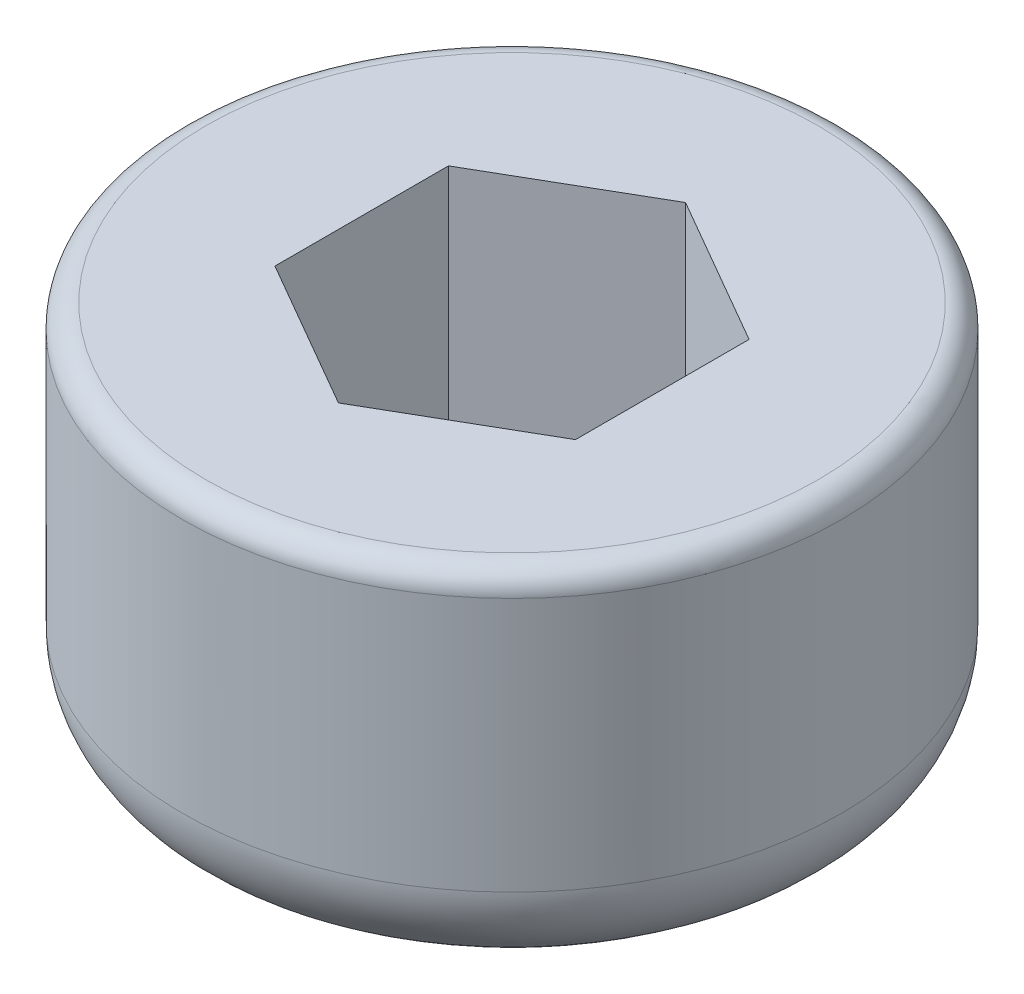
ISO-10303-21;
HEADER;
FILE_DESCRIPTION(('STEP AP214'),'2;1');
FILE_NAME('part.step','',(''),(''),'','','');
FILE_SCHEMA(('AUTOMOTIVE_DESIGN { 1 0 10303 214 1 1 1 1 }'));
ENDSEC;
DATA;
#1=APPLICATION_CONTEXT('core data for automotive mechanical design processes');
#2=APPLICATION_PROTOCOL_DEFINITION('international standard','automotive_design',2000,#1);
#3=PRODUCT_CONTEXT('',#1,'mechanical');
#4=PRODUCT('Part','Part','',(#3));
#5=PRODUCT_RELATED_PRODUCT_CATEGORY('part','',(#4));
#6=PRODUCT_DEFINITION_FORMATION('','',#4);
#7=PRODUCT_DEFINITION_CONTEXT('part definition',#1,'design');
#8=PRODUCT_DEFINITION('design','',#6,#7);
#9=PRODUCT_DEFINITION_SHAPE('','',#8);
#10=(LENGTH_UNIT() NAMED_UNIT(*) SI_UNIT(.MILLI.,.METRE.));
#11=(NAMED_UNIT(*) PLANE_ANGLE_UNIT() SI_UNIT($,.RADIAN.));
#12=(NAMED_UNIT(*) SI_UNIT($,.STERADIAN.) SOLID_ANGLE_UNIT());
#13=UNCERTAINTY_MEASURE_WITH_UNIT(LENGTH_MEASURE(1.E-05),#10,'distance_accuracy_value','');
#14=(GEOMETRIC_REPRESENTATION_CONTEXT(3) GLOBAL_UNCERTAINTY_ASSIGNED_CONTEXT((#13)) GLOBAL_UNIT_ASSIGNED_CONTEXT((#10,
#11,#12)) REPRESENTATION_CONTEXT('',''));
#15=CARTESIAN_POINT('',(0.,0.,0.));
#16=DIRECTION('',(0.,0.,1.));
#17=DIRECTION('',(1.,0.,0.));
#18=AXIS2_PLACEMENT_3D('',#15,#16,#17);
#19=CARTESIAN_POINT('',(0.,16.,0.));
#20=DIRECTION('',(0.,1.,0.));
#21=DIRECTION('',(-1.,0.,0.));
#22=AXIS2_PLACEMENT_3D('',#19,#20,#21);
#23=PLANE('',#22);
#24=CARTESIAN_POINT('',(0.,16.,0.));
#25=DIRECTION('',(0.,1.,0.));
#26=DIRECTION('',(-1.,0.,0.));
#27=AXIS2_PLACEMENT_3D('',#24,#25,#26);
#28=CIRCLE('',#27,13.25);
#29=CARTESIAN_POINT('',(-13.25,16.,0.));
#30=VERTEX_POINT('',#29);
#31=EDGE_CURVE('E11',#30,#30,#28,.T.);
#32=ORIENTED_EDGE('',*,*,#31,.T.);
#33=EDGE_LOOP('',(#32));
#34=FACE_BOUND('',#33,.T.);
#35=DIRECTION('',(-0.866025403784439,0.,-0.5));
#36=VECTOR('',#35,1.);
#37=CARTESIAN_POINT('',(6.5,16.,-3.75277674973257));
#38=LINE('',#37,#36);
#39=CARTESIAN_POINT('',(6.5,16.,-3.75277674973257));
#40=VERTEX_POINT('',#39);
#41=CARTESIAN_POINT('',(0.,16.,-7.50555349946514));
#42=VERTEX_POINT('',#41);
#43=EDGE_CURVE('E49',#40,#42,#38,.T.);
#44=ORIENTED_EDGE('',*,*,#43,.F.);
#45=DIRECTION('',(0.,0.,-1.));
#46=VECTOR('',#45,1.);
#47=CARTESIAN_POINT('',(6.5,16.,3.75277674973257));
#48=LINE('',#47,#46);
#49=CARTESIAN_POINT('',(6.5,16.,3.75277674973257));
#50=VERTEX_POINT('',#49);
#51=EDGE_CURVE('E106',#50,#40,#48,.T.);
#52=ORIENTED_EDGE('',*,*,#51,.F.);
#53=DIRECTION('',(0.866025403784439,0.,-0.5));
#54=VECTOR('',#53,1.);
#55=CARTESIAN_POINT('',(0.,16.,7.50555349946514));
#56=LINE('',#55,#54);
#57=CARTESIAN_POINT('',(0.,16.,7.50555349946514));
#58=VERTEX_POINT('',#57);
#59=EDGE_CURVE('E109',#58,#50,#56,.T.);
#60=ORIENTED_EDGE('',*,*,#59,.F.);
#61=DIRECTION('',(0.866025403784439,0.,0.5));
#62=VECTOR('',#61,1.);
#63=CARTESIAN_POINT('',(-6.50000000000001,16.,3.75277674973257));
#64=LINE('',#63,#62);
#65=CARTESIAN_POINT('',(-6.50000000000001,16.,3.75277674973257));
#66=VERTEX_POINT('',#65);
#67=EDGE_CURVE('E125',#66,#58,#64,.T.);
#68=ORIENTED_EDGE('',*,*,#67,.F.);
#69=DIRECTION('',(0.,0.,1.));
#70=VECTOR('',#69,1.);
#71=CARTESIAN_POINT('',(-6.50000000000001,16.,-3.75277674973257));
#72=LINE('',#71,#70);
#73=CARTESIAN_POINT('',(-6.50000000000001,16.,-3.75277674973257));
#74=VERTEX_POINT('',#73);
#75=EDGE_CURVE('E122',#74,#66,#72,.T.);
#76=ORIENTED_EDGE('',*,*,#75,.F.);
#77=DIRECTION('',(-0.866025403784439,0.,0.5));
#78=VECTOR('',#77,1.);
#79=CARTESIAN_POINT('',(0.,16.,-7.50555349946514));
#80=LINE('',#79,#78);
#81=EDGE_CURVE('E120',#42,#74,#80,.T.);
#82=ORIENTED_EDGE('',*,*,#81,.F.);
#83=EDGE_LOOP('',(#44,#52,#60,#68,#76,#82));
#84=FACE_BOUND('',#83,.T.);
#85=ADVANCED_FACE('F34',(#34,#84),#23,.T.);
#86=CARTESIAN_POINT('',(0.,0.,0.));
#87=DIRECTION('',(0.,-1.,0.));
#88=DIRECTION('',(1.,0.,0.));
#89=AXIS2_PLACEMENT_3D('',#86,#87,#88);
#90=CYLINDRICAL_SURFACE('',#89,14.25);
#91=CARTESIAN_POINT('',(0.,15.,0.));
#92=DIRECTION('',(0.,1.,0.));
#93=DIRECTION('',(-1.,0.,0.));
#94=AXIS2_PLACEMENT_3D('',#91,#92,#93);
#95=CIRCLE('',#94,14.25);
#96=CARTESIAN_POINT('',(-14.25,15.,0.));
#97=VERTEX_POINT('',#96);
#98=EDGE_CURVE('E42',#97,#97,#95,.F.);
#99=ORIENTED_EDGE('',*,*,#98,.T.);
#100=EDGE_LOOP('',(#99));
#101=FACE_BOUND('',#100,.T.);
#102=CARTESIAN_POINT('',(0.,4.00000000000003,0.));
#103=DIRECTION('',(0.,-1.,0.));
#104=DIRECTION('',(1.,0.,0.));
#105=AXIS2_PLACEMENT_3D('',#102,#103,#104);
#106=CIRCLE('',#105,14.25);
#107=CARTESIAN_POINT('',(14.25,4.00000000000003,0.));
#108=VERTEX_POINT('',#107);
#109=EDGE_CURVE('E142',#108,#108,#106,.T.);
#110=ORIENTED_EDGE('',*,*,#109,.F.);
#111=EDGE_LOOP('',(#110));
#112=FACE_BOUND('',#111,.T.);
#113=ADVANCED_FACE('F147',(#101,#112),#90,.T.);
#114=CARTESIAN_POINT('',(0.,4.,0.));
#115=DIRECTION('',(0.,-1.,0.));
#116=DIRECTION('',(1.,0.,0.));
#117=AXIS2_PLACEMENT_3D('',#114,#115,#116);
#118=TOROIDAL_SURFACE('',#117,10.25,4.);
#119=ORIENTED_EDGE('',*,*,#109,.T.);
#120=EDGE_LOOP('',(#119));
#121=FACE_BOUND('',#120,.T.);
#122=CARTESIAN_POINT('',(0.,0.,0.));
#123=DIRECTION('',(0.,-1.,0.));
#124=DIRECTION('',(1.,0.,0.));
#125=AXIS2_PLACEMENT_3D('',#122,#123,#124);
#126=CIRCLE('',#125,10.25);
#127=CARTESIAN_POINT('',(10.25,0.,0.));
#128=VERTEX_POINT('',#127);
#129=EDGE_CURVE('E132',#128,#128,#126,.T.);
#130=ORIENTED_EDGE('',*,*,#129,.F.);
#131=EDGE_LOOP('',(#130));
#132=FACE_BOUND('',#131,.T.);
#133=ADVANCED_FACE('F163',(#121,#132),#118,.T.);
#134=CARTESIAN_POINT('',(0.,0.,0.));
#135=DIRECTION('',(0.,-1.,0.));
#136=DIRECTION('',(1.,0.,0.));
#137=AXIS2_PLACEMENT_3D('',#134,#135,#136);
#138=PLANE('',#137);
#139=DIRECTION('',(-0.866025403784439,0.,-0.5));
#140=VECTOR('',#139,1.);
#141=CARTESIAN_POINT('',(6.5,0.,-3.75277674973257));
#142=LINE('',#141,#140);
#143=CARTESIAN_POINT('',(6.5,0.,-3.75277674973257));
#144=VERTEX_POINT('',#143);
#145=CARTESIAN_POINT('',(0.,0.,-7.50555349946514));
#146=VERTEX_POINT('',#145);
#147=EDGE_CURVE('E89',#144,#146,#142,.T.);
#148=ORIENTED_EDGE('',*,*,#147,.T.);
#149=DIRECTION('',(-0.866025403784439,0.,0.5));
#150=VECTOR('',#149,1.);
#151=CARTESIAN_POINT('',(0.,0.,-7.50555349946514));
#152=LINE('',#151,#150);
#153=CARTESIAN_POINT('',(-6.5,0.,-3.75277674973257));
#154=VERTEX_POINT('',#153);
#155=EDGE_CURVE('E98',#146,#154,#152,.T.);
#156=ORIENTED_EDGE('',*,*,#155,.T.);
#157=DIRECTION('',(0.,0.,1.));
#158=VECTOR('',#157,1.);
#159=CARTESIAN_POINT('',(-6.5,0.,-3.75277674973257));
#160=LINE('',#159,#158);
#161=CARTESIAN_POINT('',(-6.5,0.,3.75277674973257));
#162=VERTEX_POINT('',#161);
#163=EDGE_CURVE('E57',#154,#162,#160,.T.);
#164=ORIENTED_EDGE('',*,*,#163,.T.);
#165=DIRECTION('',(0.866025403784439,0.,0.5));
#166=VECTOR('',#165,1.);
#167=CARTESIAN_POINT('',(-6.5,0.,3.75277674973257));
#168=LINE('',#167,#166);
#169=CARTESIAN_POINT('',(0.,0.,7.50555349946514));
#170=VERTEX_POINT('',#169);
#171=EDGE_CURVE('E113',#162,#170,#168,.T.);
#172=ORIENTED_EDGE('',*,*,#171,.T.);
#173=DIRECTION('',(0.866025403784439,0.,-0.5));
#174=VECTOR('',#173,1.);
#175=CARTESIAN_POINT('',(0.,0.,7.50555349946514));
#176=LINE('',#175,#174);
#177=CARTESIAN_POINT('',(6.5,0.,3.75277674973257));
#178=VERTEX_POINT('',#177);
#179=EDGE_CURVE('E116',#170,#178,#176,.T.);
#180=ORIENTED_EDGE('',*,*,#179,.T.);
#181=DIRECTION('',(0.,0.,-1.));
#182=VECTOR('',#181,1.);
#183=CARTESIAN_POINT('',(6.5,0.,3.75277674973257));
#184=LINE('',#183,#182);
#185=EDGE_CURVE('E95',#178,#144,#184,.T.);
#186=ORIENTED_EDGE('',*,*,#185,.T.);
#187=EDGE_LOOP('',(#148,#156,#164,#172,#180,#186));
#188=FACE_BOUND('',#187,.T.);
#189=ORIENTED_EDGE('',*,*,#129,.T.);
#190=EDGE_LOOP('',(#189));
#191=FACE_BOUND('',#190,.T.);
#192=ADVANCED_FACE('F102',(#188,#191),#138,.T.);
#193=CARTESIAN_POINT('',(6.5,0.,-3.75277674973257));
#194=DIRECTION('',(0.5,0.,-0.866025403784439));
#195=DIRECTION('',(-0.866025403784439,0.,-0.5));
#196=AXIS2_PLACEMENT_3D('',#193,#194,#195);
#197=PLANE('',#196);
#198=ORIENTED_EDGE('',*,*,#43,.T.);
#199=DIRECTION('',(0.,1.,0.));
#200=VECTOR('',#199,1.);
#201=CARTESIAN_POINT('',(0.,0.,-7.50555349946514));
#202=LINE('',#201,#200);
#203=EDGE_CURVE('E85',#146,#42,#202,.T.);
#204=ORIENTED_EDGE('',*,*,#203,.F.);
#205=ORIENTED_EDGE('',*,*,#147,.F.);
#206=DIRECTION('',(0.,1.,0.));
#207=VECTOR('',#206,1.);
#208=CARTESIAN_POINT('',(6.5,0.,-3.75277674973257));
#209=LINE('',#208,#207);
#210=EDGE_CURVE('E130',#144,#40,#209,.T.);
#211=ORIENTED_EDGE('',*,*,#210,.T.);
#212=EDGE_LOOP('',(#198,#204,#205,#211));
#213=FACE_BOUND('',#212,.T.);
#214=ADVANCED_FACE('F87',(#213),#197,.F.);
#215=CARTESIAN_POINT('',(6.5,0.,3.75277674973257));
#216=DIRECTION('',(1.,0.,0.));
#217=DIRECTION('',(0.,1.,0.));
#218=AXIS2_PLACEMENT_3D('',#215,#216,#217);
#219=PLANE('',#218);
#220=ORIENTED_EDGE('',*,*,#51,.T.);
#221=ORIENTED_EDGE('',*,*,#210,.F.);
#222=ORIENTED_EDGE('',*,*,#185,.F.);
#223=DIRECTION('',(0.,1.,0.));
#224=VECTOR('',#223,1.);
#225=CARTESIAN_POINT('',(6.5,0.,3.75277674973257));
#226=LINE('',#225,#224);
#227=EDGE_CURVE('E133',#178,#50,#226,.T.);
#228=ORIENTED_EDGE('',*,*,#227,.T.);
#229=EDGE_LOOP('',(#220,#221,#222,#228));
#230=FACE_BOUND('',#229,.T.);
#231=ADVANCED_FACE('F173',(#230),#219,.F.);
#232=CARTESIAN_POINT('',(0.,0.,7.50555349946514));
#233=DIRECTION('',(0.5,0.,0.866025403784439));
#234=DIRECTION('',(0.866025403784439,0.,-0.5));
#235=AXIS2_PLACEMENT_3D('',#232,#233,#234);
#236=PLANE('',#235);
#237=ORIENTED_EDGE('',*,*,#59,.T.);
#238=ORIENTED_EDGE('',*,*,#227,.F.);
#239=ORIENTED_EDGE('',*,*,#179,.F.);
#240=DIRECTION('',(0.,1.,0.));
#241=VECTOR('',#240,1.);
#242=CARTESIAN_POINT('',(0.,0.,7.50555349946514));
#243=LINE('',#242,#241);
#244=EDGE_CURVE('E135',#170,#58,#243,.T.);
#245=ORIENTED_EDGE('',*,*,#244,.T.);
#246=EDGE_LOOP('',(#237,#238,#239,#245));
#247=FACE_BOUND('',#246,.T.);
#248=ADVANCED_FACE('F180',(#247),#236,.F.);
#249=CARTESIAN_POINT('',(-6.5,0.,3.75277674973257));
#250=DIRECTION('',(-0.5,0.,0.866025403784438));
#251=DIRECTION('',(0.866025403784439,0.,0.5));
#252=AXIS2_PLACEMENT_3D('',#249,#250,#251);
#253=PLANE('',#252);
#254=ORIENTED_EDGE('',*,*,#67,.T.);
#255=ORIENTED_EDGE('',*,*,#244,.F.);
#256=ORIENTED_EDGE('',*,*,#171,.F.);
#257=DIRECTION('',(0.,1.,0.));
#258=VECTOR('',#257,1.);
#259=CARTESIAN_POINT('',(-6.5,0.,3.75277674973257));
#260=LINE('',#259,#258);
#261=EDGE_CURVE('E137',#162,#66,#260,.T.);
#262=ORIENTED_EDGE('',*,*,#261,.T.);
#263=EDGE_LOOP('',(#254,#255,#256,#262));
#264=FACE_BOUND('',#263,.T.);
#265=ADVANCED_FACE('F177',(#264),#253,.F.);
#266=CARTESIAN_POINT('',(-6.5,0.,-3.75277674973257));
#267=DIRECTION('',(-1.,0.,0.));
#268=DIRECTION('',(0.,0.,1.));
#269=AXIS2_PLACEMENT_3D('',#266,#267,#268);
#270=PLANE('',#269);
#271=ORIENTED_EDGE('',*,*,#75,.T.);
#272=ORIENTED_EDGE('',*,*,#261,.F.);
#273=ORIENTED_EDGE('',*,*,#163,.F.);
#274=DIRECTION('',(0.,1.,0.));
#275=VECTOR('',#274,1.);
#276=CARTESIAN_POINT('',(-6.5,0.,-3.75277674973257));
#277=LINE('',#276,#275);
#278=EDGE_CURVE('E94',#154,#74,#277,.T.);
#279=ORIENTED_EDGE('',*,*,#278,.T.);
#280=EDGE_LOOP('',(#271,#272,#273,#279));
#281=FACE_BOUND('',#280,.T.);
#282=ADVANCED_FACE('F155',(#281),#270,.F.);
#283=CARTESIAN_POINT('',(0.,0.,-7.50555349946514));
#284=DIRECTION('',(-0.5,0.,-0.866025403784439));
#285=DIRECTION('',(-0.866025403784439,0.,0.5));
#286=AXIS2_PLACEMENT_3D('',#283,#284,#285);
#287=PLANE('',#286);
#288=ORIENTED_EDGE('',*,*,#81,.T.);
#289=ORIENTED_EDGE('',*,*,#278,.F.);
#290=ORIENTED_EDGE('',*,*,#155,.F.);
#291=ORIENTED_EDGE('',*,*,#203,.T.);
#292=EDGE_LOOP('',(#288,#289,#290,#291));
#293=FACE_BOUND('',#292,.T.);
#294=ADVANCED_FACE('F99',(#293),#287,.F.);
#295=CARTESIAN_POINT('',(0.,15.,0.));
#296=DIRECTION('',(0.,1.,0.));
#297=DIRECTION('',(-1.,0.,0.));
#298=AXIS2_PLACEMENT_3D('',#295,#296,#297);
#299=TOROIDAL_SURFACE('',#298,13.25,1.);
#300=ORIENTED_EDGE('',*,*,#31,.F.);
#301=EDGE_LOOP('',(#300));
#302=FACE_BOUND('',#301,.T.);
#303=ORIENTED_EDGE('',*,*,#98,.F.);
#304=EDGE_LOOP('',(#303));
#305=FACE_BOUND('',#304,.T.);
#306=ADVANCED_FACE('F36',(#302,#305),#299,.T.);
#307=CLOSED_SHELL('',(#85,#113,#133,#192,#214,#231,#248,#265,#282,#294,#306));
#308=MANIFOLD_SOLID_BREP('B2',#307);
#309=ADVANCED_BREP_SHAPE_REPRESENTATION('',(#18,#308),#14);
#310=SHAPE_DEFINITION_REPRESENTATION(#9,#309);
ENDSEC;
END-ISO-10303-21;
